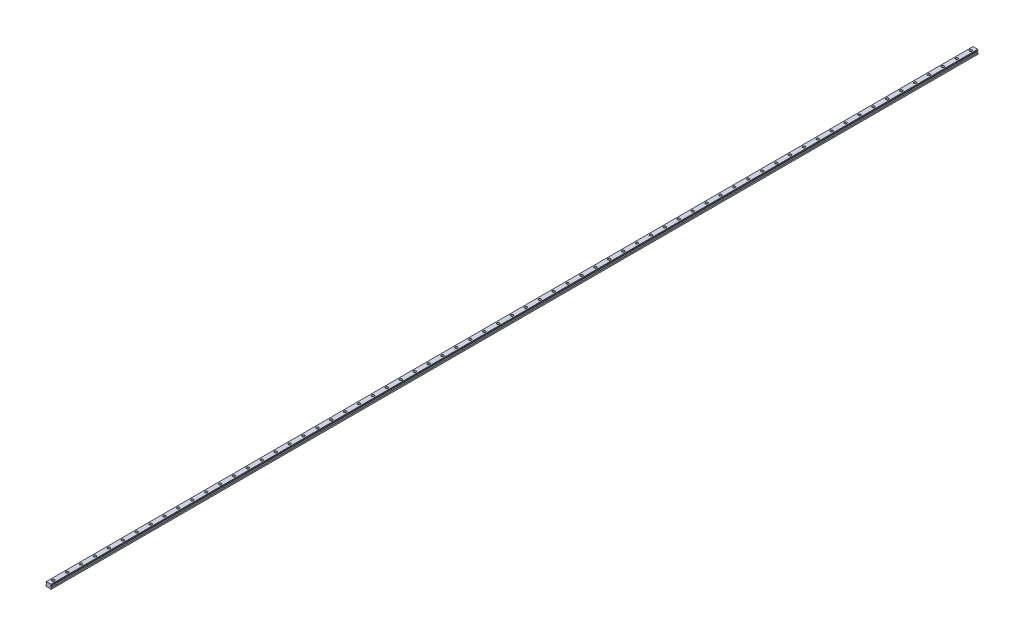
from build123d import *

# Parameters (mm, degrees)
SKETCH1_W           = 23
SKETCH1_H           = 19.2
BOSS_EXTRUDE1_DEPTH = 2000
CUT_EXTRUDE1_DEPTH  = 4001.06261076
CHAMFER1_SIZE       = 1.25
FILLET1_R           = 1.25
CUT_EXTRUDE2_DEPTH  = 4001.06261076
SKETCH4_R           = 5.5
SKETCH4_R_2         = 3.5
CUT_EXTRUDE3_DEPTH  = 9
SKETCH4_2_R         = 3.5
CUT_EXTRUDE4_DEPTH  = 2001.12521858
LPATTERN1_COUNT     = 67
LPATTERN1_PITCH     = 60


with BuildPart() as part:
    # Sketch1 → Boss-Extrude1 (new, symmetric)
    with BuildSketch(Plane.XY):
        with Locations((0, 9.6)):
            Rectangle(SKETCH1_W, SKETCH1_H)
    extrude(amount=BOSS_EXTRUDE1_DEPTH, both=True)

    # Sketch2 → Cut-Extrude1 (cut, through all)
    with BuildSketch(Plane.XY.offset(2000)):
        Polygon((-11.5, 16.7), (-11.5, 7.95), (-8.583333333, 10.866666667), (-8.583333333, 13.783333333), align=None)
        Polygon((8.583333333, 13.783333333), (11.5, 16.7), (11.5, 7.95), (8.583333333, 10.866666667), align=None)
    extrude(amount=-CUT_EXTRUDE1_DEPTH, mode=Mode.SUBTRACT)

    # Chamfer1
    chamfer1_edges = [part.edges().sort_by_distance(p)[0] for p in [
        (-11.5, 19.2, 0),
        (11.5, 19.2, 0),
        (11.5, 0, 0),
        (-11.5, 0, 0),
    ]]
    chamfer(chamfer1_edges, length=CHAMFER1_SIZE)

    # Fillet1
    fillet1_edges = [part.edges().sort_by_distance(p)[0] for p in [
        (-8.583333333, 13.783333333, 0),
        (-8.583333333, 10.866666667, 0),
        (8.583333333, 10.866666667, 0),
        (8.583333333, 13.783333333, 0),
    ]]
    fillet(fillet1_edges, radius=FILLET1_R)

    # Sketch3 → Cut-Extrude2 (cut, through all)
    with BuildSketch(Plane.XY.offset(2000)):
        Polygon((-7, 0), (-5.75, 1.25), (5.75, 1.25), (7, 0), align=None)
    extrude(amount=-CUT_EXTRUDE2_DEPTH, mode=Mode.SUBTRACT)

    # Sketch4 → Cut-Extrude3 (cut)
    with BuildSketch(Plane(origin=(0, 19.2, 0), x_dir=(1, 0, 0), z_dir=(0, 1, 0))):
        with Locations(Location((0, -1980, 0), (0, 0, 270))):
            Circle(SKETCH4_R)
        with Locations(Location((0, -1980, 0), (0, 0, 270))):
            Circle(SKETCH4_R_2, mode=Mode.SUBTRACT)
    cut_extrude3 = extrude(amount=-CUT_EXTRUDE3_DEPTH, mode=Mode.SUBTRACT)

    # Sketch4_2 → Cut-Extrude4 (cut, through all)
    with BuildSketch(Plane(origin=(0, 19.2, 0), x_dir=(1, 0, 0), z_dir=(0, 1, 0))):
        with Locations(Location((0, -1980, 0), (0, 0, 270))):
            Circle(SKETCH4_2_R)
    cut_extrude4 = extrude(amount=-CUT_EXTRUDE4_DEPTH, mode=Mode.SUBTRACT)

    # LPattern1: Cut-Extrude3, Cut-Extrude4 ×67
    with Locations(*[(0, 0, -i * LPATTERN1_PITCH) for i in range(1, LPATTERN1_COUNT)]):
        add(cut_extrude3, mode=Mode.SUBTRACT)
        add(cut_extrude4, mode=Mode.SUBTRACT)


solid = part.part
